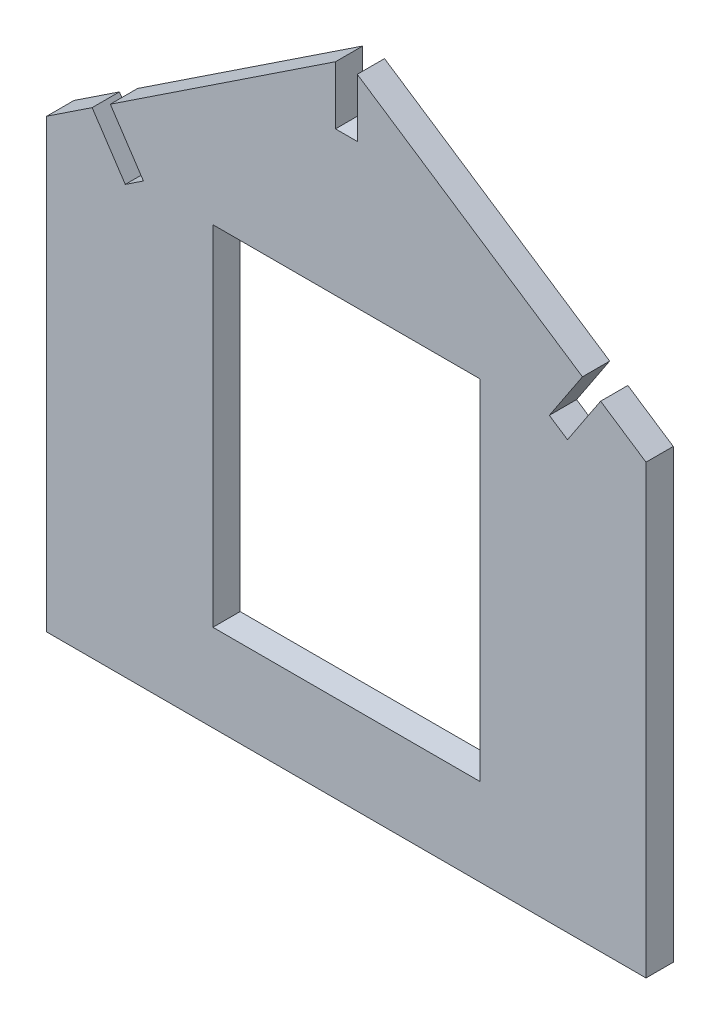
ISO-10303-21;
HEADER;
FILE_DESCRIPTION(('STEP AP214'),'2;1');
FILE_NAME('part.step','',(''),(''),'','','');
FILE_SCHEMA(('AUTOMOTIVE_DESIGN { 1 0 10303 214 1 1 1 1 }'));
ENDSEC;
DATA;
#1=APPLICATION_CONTEXT('core data for automotive mechanical design processes');
#2=APPLICATION_PROTOCOL_DEFINITION('international standard','automotive_design',2000,#1);
#3=PRODUCT_CONTEXT('',#1,'mechanical');
#4=PRODUCT('Part','Part','',(#3));
#5=PRODUCT_RELATED_PRODUCT_CATEGORY('part','',(#4));
#6=PRODUCT_DEFINITION_FORMATION('','',#4);
#7=PRODUCT_DEFINITION_CONTEXT('part definition',#1,'design');
#8=PRODUCT_DEFINITION('design','',#6,#7);
#9=PRODUCT_DEFINITION_SHAPE('','',#8);
#10=(LENGTH_UNIT() NAMED_UNIT(*) SI_UNIT(.MILLI.,.METRE.));
#11=(NAMED_UNIT(*) PLANE_ANGLE_UNIT() SI_UNIT($,.RADIAN.));
#12=(NAMED_UNIT(*) SI_UNIT($,.STERADIAN.) SOLID_ANGLE_UNIT());
#13=UNCERTAINTY_MEASURE_WITH_UNIT(LENGTH_MEASURE(1.E-05),#10,'distance_accuracy_value','');
#14=(GEOMETRIC_REPRESENTATION_CONTEXT(3) GLOBAL_UNCERTAINTY_ASSIGNED_CONTEXT((#13)) GLOBAL_UNIT_ASSIGNED_CONTEXT((#10,
#11,#12)) REPRESENTATION_CONTEXT('',''));
#15=CARTESIAN_POINT('',(0.,0.,0.));
#16=DIRECTION('',(0.,0.,1.));
#17=DIRECTION('',(1.,0.,0.));
#18=AXIS2_PLACEMENT_3D('',#15,#16,#17);
#19=CARTESIAN_POINT('',(-55.,41.,-5.));
#20=DIRECTION('',(-0.552770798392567,0.833333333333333,0.));
#21=DIRECTION('',(-0.833333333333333,-0.552770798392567,0.));
#22=AXIS2_PLACEMENT_3D('',#19,#20,#21);
#23=PLANE('',#22);
#24=DIRECTION('',(-0.833333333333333,-0.552770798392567,0.));
#25=VECTOR('',#24,1.);
#26=CARTESIAN_POINT('',(-55.,41.,0.));
#27=LINE('',#26,#25);
#28=CARTESIAN_POINT('',(-2.,76.1562227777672,0.));
#29=VERTEX_POINT('',#28);
#30=CARTESIAN_POINT('',(-43.3333333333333,48.7387911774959,0.));
#31=VERTEX_POINT('',#30);
#32=EDGE_CURVE('E267',#29,#31,#27,.T.);
#33=ORIENTED_EDGE('',*,*,#32,.F.);
#34=DIRECTION('',(0.,0.,-1.));
#35=VECTOR('',#34,1.);
#36=CARTESIAN_POINT('',(-2.00000000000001,76.1562227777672,-5.));
#37=LINE('',#36,#35);
#38=CARTESIAN_POINT('',(-2.00000000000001,76.1562227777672,-5.));
#39=VERTEX_POINT('',#38);
#40=EDGE_CURVE('E183',#29,#39,#37,.T.);
#41=ORIENTED_EDGE('',*,*,#40,.T.);
#42=DIRECTION('',(-0.833333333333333,-0.552770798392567,0.));
#43=VECTOR('',#42,1.);
#44=CARTESIAN_POINT('',(-55.,41.,-5.));
#45=LINE('',#44,#43);
#46=CARTESIAN_POINT('',(-43.3333333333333,48.7387911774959,-5.));
#47=VERTEX_POINT('',#46);
#48=EDGE_CURVE('E181',#39,#47,#45,.T.);
#49=ORIENTED_EDGE('',*,*,#48,.T.);
#50=DIRECTION('',(0.,0.,-1.));
#51=VECTOR('',#50,1.);
#52=CARTESIAN_POINT('',(-43.3333333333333,48.7387911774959,1.58085940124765));
#53=LINE('',#52,#51);
#54=EDGE_CURVE('E204',#31,#47,#53,.T.);
#55=ORIENTED_EDGE('',*,*,#54,.F.);
#56=EDGE_LOOP('',(#33,#41,#49,#55));
#57=FACE_BOUND('',#56,.T.);
#58=ADVANCED_FACE('F27',(#57),#23,.T.);
#59=CARTESIAN_POINT('',(0.,77.4828726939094,-5.));
#60=DIRECTION('',(0.552770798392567,0.833333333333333,0.));
#61=DIRECTION('',(-0.833333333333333,0.552770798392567,0.));
#62=AXIS2_PLACEMENT_3D('',#59,#60,#61);
#63=PLANE('',#62);
#64=DIRECTION('',(-0.833333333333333,0.552770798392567,0.));
#65=VECTOR('',#64,1.);
#66=CARTESIAN_POINT('',(0.,77.4828726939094,-5.));
#67=LINE('',#66,#65);
#68=CARTESIAN_POINT('',(43.3333333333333,48.7387911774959,-5.));
#69=VERTEX_POINT('',#68);
#70=CARTESIAN_POINT('',(2.,76.1562227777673,-5.));
#71=VERTEX_POINT('',#70);
#72=EDGE_CURVE('E278',#69,#71,#67,.T.);
#73=ORIENTED_EDGE('',*,*,#72,.T.);
#74=DIRECTION('',(0.,0.,1.));
#75=VECTOR('',#74,1.);
#76=CARTESIAN_POINT('',(2.,76.1562227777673,-5.));
#77=LINE('',#76,#75);
#78=CARTESIAN_POINT('',(2.,76.1562227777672,0.));
#79=VERTEX_POINT('',#78);
#80=EDGE_CURVE('E170',#71,#79,#77,.T.);
#81=ORIENTED_EDGE('',*,*,#80,.T.);
#82=DIRECTION('',(-0.833333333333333,0.552770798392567,0.));
#83=VECTOR('',#82,1.);
#84=CARTESIAN_POINT('',(0.,77.4828726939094,0.));
#85=LINE('',#84,#83);
#86=CARTESIAN_POINT('',(43.3333333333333,48.7387911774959,0.));
#87=VERTEX_POINT('',#86);
#88=EDGE_CURVE('E262',#87,#79,#85,.T.);
#89=ORIENTED_EDGE('',*,*,#88,.F.);
#90=DIRECTION('',(0.,0.,1.));
#91=VECTOR('',#90,1.);
#92=CARTESIAN_POINT('',(43.3333333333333,48.7387911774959,2.15028164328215));
#93=LINE('',#92,#91);
#94=EDGE_CURVE('E185',#69,#87,#93,.T.);
#95=ORIENTED_EDGE('',*,*,#94,.F.);
#96=EDGE_LOOP('',(#73,#81,#89,#95));
#97=FACE_BOUND('',#96,.T.);
#98=ADVANCED_FACE('F321',(#97),#63,.T.);
#99=CARTESIAN_POINT('',(-55.,-41.,-5.));
#100=DIRECTION('',(0.,0.,1.));
#101=DIRECTION('',(1.,0.,0.));
#102=AXIS2_PLACEMENT_3D('',#99,#100,#101);
#103=PLANE('',#102);
#104=DIRECTION('',(-1.,0.,0.));
#105=VECTOR('',#104,1.);
#106=CARTESIAN_POINT('',(-24.5,39.,-5.));
#107=LINE('',#106,#105);
#108=CARTESIAN_POINT('',(24.5,39.,-5.));
#109=VERTEX_POINT('',#108);
#110=CARTESIAN_POINT('',(-24.5,39.,-5.));
#111=VERTEX_POINT('',#110);
#112=EDGE_CURVE('E241',#109,#111,#107,.T.);
#113=ORIENTED_EDGE('',*,*,#112,.T.);
#114=DIRECTION('',(0.,-1.,0.));
#115=VECTOR('',#114,1.);
#116=CARTESIAN_POINT('',(-24.5,39.,-5.));
#117=LINE('',#116,#115);
#118=CARTESIAN_POINT('',(-24.5,-25.,-5.));
#119=VERTEX_POINT('',#118);
#120=EDGE_CURVE('E232',#111,#119,#117,.T.);
#121=ORIENTED_EDGE('',*,*,#120,.T.);
#122=DIRECTION('',(1.,0.,0.));
#123=VECTOR('',#122,1.);
#124=CARTESIAN_POINT('',(-24.5,-25.,-5.));
#125=LINE('',#124,#123);
#126=CARTESIAN_POINT('',(24.5,-25.,-5.));
#127=VERTEX_POINT('',#126);
#128=EDGE_CURVE('E235',#119,#127,#125,.T.);
#129=ORIENTED_EDGE('',*,*,#128,.T.);
#130=DIRECTION('',(0.,1.,0.));
#131=VECTOR('',#130,1.);
#132=CARTESIAN_POINT('',(24.5,39.,-5.));
#133=LINE('',#132,#131);
#134=EDGE_CURVE('E238',#127,#109,#133,.T.);
#135=ORIENTED_EDGE('',*,*,#134,.T.);
#136=EDGE_LOOP('',(#113,#121,#129,#135));
#137=FACE_BOUND('',#136,.T.);
#138=DIRECTION('',(0.,1.,0.));
#139=VECTOR('',#138,1.);
#140=CARTESIAN_POINT('',(-2.,-41.,-5.));
#141=LINE('',#140,#139);
#142=CARTESIAN_POINT('',(-2.,65.4828726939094,-5.));
#143=VERTEX_POINT('',#142);
#144=EDGE_CURVE('E174',#143,#39,#141,.T.);
#145=ORIENTED_EDGE('',*,*,#144,.F.);
#146=DIRECTION('',(-1.,0.,0.));
#147=VECTOR('',#146,1.);
#148=CARTESIAN_POINT('',(-55.,65.4828726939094,-5.));
#149=LINE('',#148,#147);
#150=CARTESIAN_POINT('',(2.,65.4828726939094,-5.));
#151=VERTEX_POINT('',#150);
#152=EDGE_CURVE('E163',#151,#143,#149,.T.);
#153=ORIENTED_EDGE('',*,*,#152,.F.);
#154=DIRECTION('',(0.,-1.,0.));
#155=VECTOR('',#154,1.);
#156=CARTESIAN_POINT('',(2.,-41.,-5.));
#157=LINE('',#156,#155);
#158=EDGE_CURVE('E187',#71,#151,#157,.T.);
#159=ORIENTED_EDGE('',*,*,#158,.F.);
#160=ORIENTED_EDGE('',*,*,#72,.F.);
#161=DIRECTION('',(-0.552770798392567,-0.833333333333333,0.));
#162=VECTOR('',#161,1.);
#163=CARTESIAN_POINT('',(-28.0504490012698,-58.8763097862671,-5.));
#164=LINE('',#163,#162);
#165=CARTESIAN_POINT('',(37.2528545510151,39.5721245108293,-5.));
#166=VERTEX_POINT('',#165);
#167=EDGE_CURVE('E198',#69,#166,#164,.T.);
#168=ORIENTED_EDGE('',*,*,#167,.T.);
#169=DIRECTION('',(-0.833333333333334,0.552770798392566,0.));
#170=VECTOR('',#169,1.);
#171=CARTESIAN_POINT('',(10.3033035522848,57.4484342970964,-5.));
#172=LINE('',#171,#170);
#173=CARTESIAN_POINT('',(40.5861878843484,37.361041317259,-5.));
#174=VERTEX_POINT('',#173);
#175=EDGE_CURVE('E196',#174,#166,#172,.T.);
#176=ORIENTED_EDGE('',*,*,#175,.F.);
#177=DIRECTION('',(0.552770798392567,0.833333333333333,0.));
#178=VECTOR('',#177,1.);
#179=CARTESIAN_POINT('',(-24.7171156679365,-61.0873929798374,-5.));
#180=LINE('',#179,#178);
#181=CARTESIAN_POINT('',(46.6666666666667,46.5277079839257,-5.));
#182=VERTEX_POINT('',#181);
#183=EDGE_CURVE('E201',#174,#182,#180,.T.);
#184=ORIENTED_EDGE('',*,*,#183,.T.);
#185=CARTESIAN_POINT('',(55.,41.,-5.));
#186=VERTEX_POINT('',#185);
#187=EDGE_CURVE('E279',#186,#182,#67,.T.);
#188=ORIENTED_EDGE('',*,*,#187,.F.);
#189=DIRECTION('',(0.,1.,0.));
#190=VECTOR('',#189,1.);
#191=CARTESIAN_POINT('',(55.,41.,-5.));
#192=LINE('',#191,#190);
#193=CARTESIAN_POINT('',(55.,-41.,-5.));
#194=VERTEX_POINT('',#193);
#195=EDGE_CURVE('E275',#194,#186,#192,.T.);
#196=ORIENTED_EDGE('',*,*,#195,.F.);
#197=DIRECTION('',(1.,0.,0.));
#198=VECTOR('',#197,1.);
#199=CARTESIAN_POINT('',(-55.,-41.,-5.));
#200=LINE('',#199,#198);
#201=CARTESIAN_POINT('',(-55.,-41.,-5.));
#202=VERTEX_POINT('',#201);
#203=EDGE_CURVE('E272',#202,#194,#200,.T.);
#204=ORIENTED_EDGE('',*,*,#203,.F.);
#205=DIRECTION('',(0.,-1.,0.));
#206=VECTOR('',#205,1.);
#207=CARTESIAN_POINT('',(-55.,41.,-5.));
#208=LINE('',#207,#206);
#209=CARTESIAN_POINT('',(-55.,41.,-5.));
#210=VERTEX_POINT('',#209);
#211=EDGE_CURVE('E269',#210,#202,#208,.T.);
#212=ORIENTED_EDGE('',*,*,#211,.F.);
#213=CARTESIAN_POINT('',(-46.6666666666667,46.5277079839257,-5.));
#214=VERTEX_POINT('',#213);
#215=EDGE_CURVE('E282',#214,#210,#45,.T.);
#216=ORIENTED_EDGE('',*,*,#215,.F.);
#217=DIRECTION('',(0.552770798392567,-0.833333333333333,0.));
#218=VECTOR('',#217,1.);
#219=CARTESIAN_POINT('',(-8.89399544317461,-10.4167364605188,-5.));
#220=LINE('',#219,#218);
#221=CARTESIAN_POINT('',(-40.5861878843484,37.361041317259,-5.));
#222=VERTEX_POINT('',#221);
#223=EDGE_CURVE('E216',#214,#222,#220,.T.);
#224=ORIENTED_EDGE('',*,*,#223,.T.);
#225=DIRECTION('',(-0.833333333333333,-0.552770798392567,0.));
#226=VECTOR('',#225,1.);
#227=CARTESIAN_POINT('',(-86.6921924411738,6.7777777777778,-5.));
#228=LINE('',#227,#226);
#229=CARTESIAN_POINT('',(-37.2528545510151,39.5721245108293,-5.));
#230=VERTEX_POINT('',#229);
#231=EDGE_CURVE('E214',#230,#222,#228,.T.);
#232=ORIENTED_EDGE('',*,*,#231,.F.);
#233=DIRECTION('',(-0.552770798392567,0.833333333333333,0.));
#234=VECTOR('',#233,1.);
#235=CARTESIAN_POINT('',(-5.56066210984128,-8.20565326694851,-5.));
#236=LINE('',#235,#234);
#237=EDGE_CURVE('E219',#230,#47,#236,.T.);
#238=ORIENTED_EDGE('',*,*,#237,.T.);
#239=ORIENTED_EDGE('',*,*,#48,.F.);
#240=EDGE_LOOP('',(#145,#153,#159,#160,#168,#176,#184,#188,#196,#204,#212,#216,#224,#232,#238,#239));
#241=FACE_BOUND('',#240,.T.);
#242=ADVANCED_FACE('F179',(#137,#241),#103,.F.);
#243=CARTESIAN_POINT('',(-55.,-41.,0.));
#244=DIRECTION('',(0.,0.,1.));
#245=DIRECTION('',(1.,0.,0.));
#246=AXIS2_PLACEMENT_3D('',#243,#244,#245);
#247=PLANE('',#246);
#248=DIRECTION('',(0.,-1.,0.));
#249=VECTOR('',#248,1.);
#250=CARTESIAN_POINT('',(-24.5,39.,0.));
#251=LINE('',#250,#249);
#252=CARTESIAN_POINT('',(-24.5,39.,0.));
#253=VERTEX_POINT('',#252);
#254=CARTESIAN_POINT('',(-24.5,-25.,0.));
#255=VERTEX_POINT('',#254);
#256=EDGE_CURVE('E221',#253,#255,#251,.T.);
#257=ORIENTED_EDGE('',*,*,#256,.F.);
#258=DIRECTION('',(-1.,0.,0.));
#259=VECTOR('',#258,1.);
#260=CARTESIAN_POINT('',(-24.5,39.,0.));
#261=LINE('',#260,#259);
#262=CARTESIAN_POINT('',(24.5,39.,0.));
#263=VERTEX_POINT('',#262);
#264=EDGE_CURVE('E229',#263,#253,#261,.T.);
#265=ORIENTED_EDGE('',*,*,#264,.F.);
#266=DIRECTION('',(0.,1.,0.));
#267=VECTOR('',#266,1.);
#268=CARTESIAN_POINT('',(24.5,39.,0.));
#269=LINE('',#268,#267);
#270=CARTESIAN_POINT('',(24.5,-25.,0.));
#271=VERTEX_POINT('',#270);
#272=EDGE_CURVE('E226',#271,#263,#269,.T.);
#273=ORIENTED_EDGE('',*,*,#272,.F.);
#274=DIRECTION('',(1.,0.,0.));
#275=VECTOR('',#274,1.);
#276=CARTESIAN_POINT('',(-24.5,-25.,0.));
#277=LINE('',#276,#275);
#278=EDGE_CURVE('E223',#255,#271,#277,.T.);
#279=ORIENTED_EDGE('',*,*,#278,.F.);
#280=EDGE_LOOP('',(#257,#265,#273,#279));
#281=FACE_BOUND('',#280,.T.);
#282=DIRECTION('',(-1.,0.,0.));
#283=VECTOR('',#282,1.);
#284=CARTESIAN_POINT('',(-55.,65.4828726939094,0.));
#285=LINE('',#284,#283);
#286=CARTESIAN_POINT('',(2.,65.4828726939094,0.));
#287=VERTEX_POINT('',#286);
#288=CARTESIAN_POINT('',(-2.,65.4828726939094,0.));
#289=VERTEX_POINT('',#288);
#290=EDGE_CURVE('E309',#287,#289,#285,.T.);
#291=ORIENTED_EDGE('',*,*,#290,.T.);
#292=DIRECTION('',(0.,1.,0.));
#293=VECTOR('',#292,1.);
#294=CARTESIAN_POINT('',(-2.,-41.,0.));
#295=LINE('',#294,#293);
#296=EDGE_CURVE('E11',#289,#29,#295,.T.);
#297=ORIENTED_EDGE('',*,*,#296,.T.);
#298=ORIENTED_EDGE('',*,*,#32,.T.);
#299=DIRECTION('',(-0.552770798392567,0.833333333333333,0.));
#300=VECTOR('',#299,1.);
#301=CARTESIAN_POINT('',(-5.56066210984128,-8.20565326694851,0.));
#302=LINE('',#301,#300);
#303=CARTESIAN_POINT('',(-37.2528545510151,39.5721245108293,0.));
#304=VERTEX_POINT('',#303);
#305=EDGE_CURVE('E299',#304,#31,#302,.T.);
#306=ORIENTED_EDGE('',*,*,#305,.F.);
#307=DIRECTION('',(-0.833333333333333,-0.552770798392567,0.));
#308=VECTOR('',#307,1.);
#309=CARTESIAN_POINT('',(-86.6921924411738,6.7777777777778,0.));
#310=LINE('',#309,#308);
#311=CARTESIAN_POINT('',(-40.5861878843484,37.361041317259,0.));
#312=VERTEX_POINT('',#311);
#313=EDGE_CURVE('E288',#304,#312,#310,.T.);
#314=ORIENTED_EDGE('',*,*,#313,.T.);
#315=DIRECTION('',(0.552770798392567,-0.833333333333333,0.));
#316=VECTOR('',#315,1.);
#317=CARTESIAN_POINT('',(-8.89399544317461,-10.4167364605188,0.));
#318=LINE('',#317,#316);
#319=CARTESIAN_POINT('',(-46.6666666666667,46.5277079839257,0.));
#320=VERTEX_POINT('',#319);
#321=EDGE_CURVE('E296',#320,#312,#318,.T.);
#322=ORIENTED_EDGE('',*,*,#321,.F.);
#323=CARTESIAN_POINT('',(-55.,41.,0.));
#324=VERTEX_POINT('',#323);
#325=EDGE_CURVE('E266',#320,#324,#27,.T.);
#326=ORIENTED_EDGE('',*,*,#325,.T.);
#327=DIRECTION('',(0.,-1.,0.));
#328=VECTOR('',#327,1.);
#329=CARTESIAN_POINT('',(-55.,41.,0.));
#330=LINE('',#329,#328);
#331=CARTESIAN_POINT('',(-55.,-41.,0.));
#332=VERTEX_POINT('',#331);
#333=EDGE_CURVE('E247',#324,#332,#330,.T.);
#334=ORIENTED_EDGE('',*,*,#333,.T.);
#335=DIRECTION('',(1.,0.,0.));
#336=VECTOR('',#335,1.);
#337=CARTESIAN_POINT('',(-55.,-41.,0.));
#338=LINE('',#337,#336);
#339=CARTESIAN_POINT('',(55.,-41.,0.));
#340=VERTEX_POINT('',#339);
#341=EDGE_CURVE('E256',#332,#340,#338,.T.);
#342=ORIENTED_EDGE('',*,*,#341,.T.);
#343=DIRECTION('',(0.,1.,0.));
#344=VECTOR('',#343,1.);
#345=CARTESIAN_POINT('',(55.,41.,0.));
#346=LINE('',#345,#344);
#347=CARTESIAN_POINT('',(55.,41.,0.));
#348=VERTEX_POINT('',#347);
#349=EDGE_CURVE('E259',#340,#348,#346,.T.);
#350=ORIENTED_EDGE('',*,*,#349,.T.);
#351=CARTESIAN_POINT('',(46.6666666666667,46.5277079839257,0.));
#352=VERTEX_POINT('',#351);
#353=EDGE_CURVE('E263',#348,#352,#85,.T.);
#354=ORIENTED_EDGE('',*,*,#353,.T.);
#355=DIRECTION('',(0.552770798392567,0.833333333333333,0.));
#356=VECTOR('',#355,1.);
#357=CARTESIAN_POINT('',(-24.7171156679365,-61.0873929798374,0.));
#358=LINE('',#357,#356);
#359=CARTESIAN_POINT('',(40.5861878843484,37.361041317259,0.));
#360=VERTEX_POINT('',#359);
#361=EDGE_CURVE('E307',#360,#352,#358,.T.);
#362=ORIENTED_EDGE('',*,*,#361,.F.);
#363=DIRECTION('',(-0.833333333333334,0.552770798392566,0.));
#364=VECTOR('',#363,1.);
#365=CARTESIAN_POINT('',(10.3033035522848,57.4484342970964,0.));
#366=LINE('',#365,#364);
#367=CARTESIAN_POINT('',(37.2528545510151,39.5721245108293,0.));
#368=VERTEX_POINT('',#367);
#369=EDGE_CURVE('E302',#360,#368,#366,.T.);
#370=ORIENTED_EDGE('',*,*,#369,.T.);
#371=DIRECTION('',(-0.552770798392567,-0.833333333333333,0.));
#372=VECTOR('',#371,1.);
#373=CARTESIAN_POINT('',(-28.0504490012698,-58.8763097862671,0.));
#374=LINE('',#373,#372);
#375=EDGE_CURVE('E305',#87,#368,#374,.T.);
#376=ORIENTED_EDGE('',*,*,#375,.F.);
#377=ORIENTED_EDGE('',*,*,#88,.T.);
#378=DIRECTION('',(0.,-1.,0.));
#379=VECTOR('',#378,1.);
#380=CARTESIAN_POINT('',(2.,-41.,0.));
#381=LINE('',#380,#379);
#382=EDGE_CURVE('E35',#79,#287,#381,.T.);
#383=ORIENTED_EDGE('',*,*,#382,.T.);
#384=EDGE_LOOP('',(#291,#297,#298,#306,#314,#322,#326,#334,#342,#350,#354,#362,#370,#376,#377,#383));
#385=FACE_BOUND('',#384,.T.);
#386=ADVANCED_FACE('F313',(#281,#385),#247,.T.);
#387=DIRECTION('',(0.,0.,-1.));
#388=VECTOR('',#387,1.);
#389=CARTESIAN_POINT('',(46.6666666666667,46.5277079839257,2.15028164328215));
#390=LINE('',#389,#388);
#391=EDGE_CURVE('E182',#352,#182,#390,.T.);
#392=ORIENTED_EDGE('',*,*,#391,.F.);
#393=ORIENTED_EDGE('',*,*,#353,.F.);
#394=DIRECTION('',(0.,0.,1.));
#395=VECTOR('',#394,1.);
#396=CARTESIAN_POINT('',(55.,41.,-5.));
#397=LINE('',#396,#395);
#398=EDGE_CURVE('E289',#186,#348,#397,.T.);
#399=ORIENTED_EDGE('',*,*,#398,.F.);
#400=ORIENTED_EDGE('',*,*,#187,.T.);
#401=EDGE_LOOP('',(#392,#393,#399,#400));
#402=FACE_BOUND('',#401,.T.);
#403=ADVANCED_FACE('F338',(#402),#63,.T.);
#404=CARTESIAN_POINT('',(-55.,41.,-5.));
#405=DIRECTION('',(-1.,0.,0.));
#406=DIRECTION('',(0.,0.,1.));
#407=AXIS2_PLACEMENT_3D('',#404,#405,#406);
#408=PLANE('',#407);
#409=ORIENTED_EDGE('',*,*,#333,.F.);
#410=DIRECTION('',(0.,0.,1.));
#411=VECTOR('',#410,1.);
#412=CARTESIAN_POINT('',(-55.,41.,-5.));
#413=LINE('',#412,#411);
#414=EDGE_CURVE('E285',#210,#324,#413,.T.);
#415=ORIENTED_EDGE('',*,*,#414,.F.);
#416=ORIENTED_EDGE('',*,*,#211,.T.);
#417=DIRECTION('',(0.,0.,1.));
#418=VECTOR('',#417,1.);
#419=CARTESIAN_POINT('',(-55.,-41.,-5.));
#420=LINE('',#419,#418);
#421=EDGE_CURVE('E284',#202,#332,#420,.T.);
#422=ORIENTED_EDGE('',*,*,#421,.T.);
#423=EDGE_LOOP('',(#409,#415,#416,#422));
#424=FACE_BOUND('',#423,.T.);
#425=ADVANCED_FACE('F29',(#424),#408,.T.);
#426=DIRECTION('',(0.,0.,1.));
#427=VECTOR('',#426,1.);
#428=CARTESIAN_POINT('',(-46.6666666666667,46.5277079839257,1.58085940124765));
#429=LINE('',#428,#427);
#430=EDGE_CURVE('E207',#214,#320,#429,.T.);
#431=ORIENTED_EDGE('',*,*,#430,.F.);
#432=ORIENTED_EDGE('',*,*,#215,.T.);
#433=ORIENTED_EDGE('',*,*,#414,.T.);
#434=ORIENTED_EDGE('',*,*,#325,.F.);
#435=EDGE_LOOP('',(#431,#432,#433,#434));
#436=FACE_BOUND('',#435,.T.);
#437=ADVANCED_FACE('F355',(#436),#23,.T.);
#438=CARTESIAN_POINT('',(55.,41.,-5.));
#439=DIRECTION('',(1.,0.,0.));
#440=DIRECTION('',(0.,0.,-1.));
#441=AXIS2_PLACEMENT_3D('',#438,#439,#440);
#442=PLANE('',#441);
#443=ORIENTED_EDGE('',*,*,#349,.F.);
#444=DIRECTION('',(0.,0.,1.));
#445=VECTOR('',#444,1.);
#446=CARTESIAN_POINT('',(55.,-41.,-5.));
#447=LINE('',#446,#445);
#448=EDGE_CURVE('E291',#194,#340,#447,.T.);
#449=ORIENTED_EDGE('',*,*,#448,.F.);
#450=ORIENTED_EDGE('',*,*,#195,.T.);
#451=ORIENTED_EDGE('',*,*,#398,.T.);
#452=EDGE_LOOP('',(#443,#449,#450,#451));
#453=FACE_BOUND('',#452,.T.);
#454=ADVANCED_FACE('F342',(#453),#442,.T.);
#455=CARTESIAN_POINT('',(-55.,-41.,-5.));
#456=DIRECTION('',(0.,-1.,0.));
#457=DIRECTION('',(0.,0.,-1.));
#458=AXIS2_PLACEMENT_3D('',#455,#456,#457);
#459=PLANE('',#458);
#460=ORIENTED_EDGE('',*,*,#341,.F.);
#461=ORIENTED_EDGE('',*,*,#421,.F.);
#462=ORIENTED_EDGE('',*,*,#203,.T.);
#463=ORIENTED_EDGE('',*,*,#448,.T.);
#464=EDGE_LOOP('',(#460,#461,#462,#463));
#465=FACE_BOUND('',#464,.T.);
#466=ADVANCED_FACE('F347',(#465),#459,.T.);
#467=CARTESIAN_POINT('',(-24.5,39.,-5.));
#468=DIRECTION('',(-1.,0.,0.));
#469=DIRECTION('',(0.,-1.,0.));
#470=AXIS2_PLACEMENT_3D('',#467,#468,#469);
#471=PLANE('',#470);
#472=ORIENTED_EDGE('',*,*,#256,.T.);
#473=DIRECTION('',(0.,0.,1.));
#474=VECTOR('',#473,1.);
#475=CARTESIAN_POINT('',(-24.5,-25.,-5.));
#476=LINE('',#475,#474);
#477=EDGE_CURVE('E244',#119,#255,#476,.T.);
#478=ORIENTED_EDGE('',*,*,#477,.F.);
#479=ORIENTED_EDGE('',*,*,#120,.F.);
#480=DIRECTION('',(0.,0.,1.));
#481=VECTOR('',#480,1.);
#482=CARTESIAN_POINT('',(-24.5,39.,-5.));
#483=LINE('',#482,#481);
#484=EDGE_CURVE('E245',#111,#253,#483,.T.);
#485=ORIENTED_EDGE('',*,*,#484,.T.);
#486=EDGE_LOOP('',(#472,#478,#479,#485));
#487=FACE_BOUND('',#486,.T.);
#488=ADVANCED_FACE('F397',(#487),#471,.F.);
#489=CARTESIAN_POINT('',(-24.5,39.,-5.));
#490=DIRECTION('',(0.,1.,0.));
#491=DIRECTION('',(0.,0.,1.));
#492=AXIS2_PLACEMENT_3D('',#489,#490,#491);
#493=PLANE('',#492);
#494=ORIENTED_EDGE('',*,*,#264,.T.);
#495=ORIENTED_EDGE('',*,*,#484,.F.);
#496=ORIENTED_EDGE('',*,*,#112,.F.);
#497=DIRECTION('',(0.,0.,1.));
#498=VECTOR('',#497,1.);
#499=CARTESIAN_POINT('',(24.5,39.,-5.));
#500=LINE('',#499,#498);
#501=EDGE_CURVE('E248',#109,#263,#500,.T.);
#502=ORIENTED_EDGE('',*,*,#501,.T.);
#503=EDGE_LOOP('',(#494,#495,#496,#502));
#504=FACE_BOUND('',#503,.T.);
#505=ADVANCED_FACE('F401',(#504),#493,.F.);
#506=CARTESIAN_POINT('',(24.5,39.,-5.));
#507=DIRECTION('',(1.,0.,0.));
#508=DIRECTION('',(0.,1.,0.));
#509=AXIS2_PLACEMENT_3D('',#506,#507,#508);
#510=PLANE('',#509);
#511=ORIENTED_EDGE('',*,*,#272,.T.);
#512=ORIENTED_EDGE('',*,*,#501,.F.);
#513=ORIENTED_EDGE('',*,*,#134,.F.);
#514=DIRECTION('',(0.,0.,1.));
#515=VECTOR('',#514,1.);
#516=CARTESIAN_POINT('',(24.5,-25.,-5.));
#517=LINE('',#516,#515);
#518=EDGE_CURVE('E250',#127,#271,#517,.T.);
#519=ORIENTED_EDGE('',*,*,#518,.T.);
#520=EDGE_LOOP('',(#511,#512,#513,#519));
#521=FACE_BOUND('',#520,.T.);
#522=ADVANCED_FACE('F407',(#521),#510,.F.);
#523=CARTESIAN_POINT('',(-24.5,-25.,-5.));
#524=DIRECTION('',(0.,-1.,0.));
#525=DIRECTION('',(0.,0.,-1.));
#526=AXIS2_PLACEMENT_3D('',#523,#524,#525);
#527=PLANE('',#526);
#528=ORIENTED_EDGE('',*,*,#278,.T.);
#529=ORIENTED_EDGE('',*,*,#518,.F.);
#530=ORIENTED_EDGE('',*,*,#128,.F.);
#531=ORIENTED_EDGE('',*,*,#477,.T.);
#532=EDGE_LOOP('',(#528,#529,#530,#531));
#533=FACE_BOUND('',#532,.T.);
#534=ADVANCED_FACE('F411',(#533),#527,.F.);
#535=CARTESIAN_POINT('',(-37.2528545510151,39.5721245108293,1.58085940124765));
#536=DIRECTION('',(0.833333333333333,0.552770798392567,0.));
#537=DIRECTION('',(-0.552770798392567,0.833333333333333,0.));
#538=AXIS2_PLACEMENT_3D('',#535,#536,#537);
#539=PLANE('',#538);
#540=DIRECTION('',(0.,0.,-1.));
#541=VECTOR('',#540,1.);
#542=CARTESIAN_POINT('',(-37.2528545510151,39.5721245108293,1.58085940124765));
#543=LINE('',#542,#541);
#544=EDGE_CURVE('E209',#304,#230,#543,.T.);
#545=ORIENTED_EDGE('',*,*,#544,.F.);
#546=ORIENTED_EDGE('',*,*,#305,.T.);
#547=ORIENTED_EDGE('',*,*,#54,.T.);
#548=ORIENTED_EDGE('',*,*,#237,.F.);
#549=EDGE_LOOP('',(#545,#546,#547,#548));
#550=FACE_BOUND('',#549,.T.);
#551=ADVANCED_FACE('F366',(#550),#539,.F.);
#552=CARTESIAN_POINT('',(-40.5861878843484,37.361041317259,1.58085940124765));
#553=DIRECTION('',(-0.833333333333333,-0.552770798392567,0.));
#554=DIRECTION('',(0.552770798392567,-0.833333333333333,0.));
#555=AXIS2_PLACEMENT_3D('',#552,#553,#554);
#556=PLANE('',#555);
#557=ORIENTED_EDGE('',*,*,#430,.T.);
#558=ORIENTED_EDGE('',*,*,#321,.T.);
#559=DIRECTION('',(0.,0.,1.));
#560=VECTOR('',#559,1.);
#561=CARTESIAN_POINT('',(-40.5861878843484,37.361041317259,1.58085940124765));
#562=LINE('',#561,#560);
#563=EDGE_CURVE('E212',#222,#312,#562,.T.);
#564=ORIENTED_EDGE('',*,*,#563,.F.);
#565=ORIENTED_EDGE('',*,*,#223,.F.);
#566=EDGE_LOOP('',(#557,#558,#564,#565));
#567=FACE_BOUND('',#566,.T.);
#568=ADVANCED_FACE('F359',(#567),#556,.F.);
#569=CARTESIAN_POINT('',(-37.2528545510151,39.5721245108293,-7.90951129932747));
#570=DIRECTION('',(-0.552770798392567,0.833333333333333,0.));
#571=DIRECTION('',(-0.833333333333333,-0.552770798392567,0.));
#572=AXIS2_PLACEMENT_3D('',#569,#570,#571);
#573=PLANE('',#572);
#574=ORIENTED_EDGE('',*,*,#231,.T.);
#575=ORIENTED_EDGE('',*,*,#563,.T.);
#576=ORIENTED_EDGE('',*,*,#313,.F.);
#577=ORIENTED_EDGE('',*,*,#544,.T.);
#578=EDGE_LOOP('',(#574,#575,#576,#577));
#579=FACE_BOUND('',#578,.T.);
#580=ADVANCED_FACE('F364',(#579),#573,.T.);
#581=CARTESIAN_POINT('',(40.5861878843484,37.361041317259,2.15028164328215));
#582=DIRECTION('',(0.833333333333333,-0.552770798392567,0.));
#583=DIRECTION('',(0.552770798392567,0.833333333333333,0.));
#584=AXIS2_PLACEMENT_3D('',#581,#582,#583);
#585=PLANE('',#584);
#586=DIRECTION('',(0.,0.,-1.));
#587=VECTOR('',#586,1.);
#588=CARTESIAN_POINT('',(40.5861878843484,37.361041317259,2.15028164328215));
#589=LINE('',#588,#587);
#590=EDGE_CURVE('E192',#360,#174,#589,.T.);
#591=ORIENTED_EDGE('',*,*,#590,.F.);
#592=ORIENTED_EDGE('',*,*,#361,.T.);
#593=ORIENTED_EDGE('',*,*,#391,.T.);
#594=ORIENTED_EDGE('',*,*,#183,.F.);
#595=EDGE_LOOP('',(#591,#592,#593,#594));
#596=FACE_BOUND('',#595,.T.);
#597=ADVANCED_FACE('F333',(#596),#585,.F.);
#598=CARTESIAN_POINT('',(37.2528545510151,39.5721245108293,2.15028164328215));
#599=DIRECTION('',(-0.833333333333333,0.552770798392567,0.));
#600=DIRECTION('',(-0.552770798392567,-0.833333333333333,0.));
#601=AXIS2_PLACEMENT_3D('',#598,#599,#600);
#602=PLANE('',#601);
#603=ORIENTED_EDGE('',*,*,#94,.T.);
#604=ORIENTED_EDGE('',*,*,#375,.T.);
#605=DIRECTION('',(0.,0.,1.));
#606=VECTOR('',#605,1.);
#607=CARTESIAN_POINT('',(37.2528545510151,39.5721245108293,2.15028164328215));
#608=LINE('',#607,#606);
#609=EDGE_CURVE('E50',#166,#368,#608,.T.);
#610=ORIENTED_EDGE('',*,*,#609,.F.);
#611=ORIENTED_EDGE('',*,*,#167,.F.);
#612=EDGE_LOOP('',(#603,#604,#610,#611));
#613=FACE_BOUND('',#612,.T.);
#614=ADVANCED_FACE('F328',(#613),#602,.F.);
#615=CARTESIAN_POINT('',(40.5861878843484,37.361041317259,-7.90951129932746));
#616=DIRECTION('',(0.552770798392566,0.833333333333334,0.));
#617=DIRECTION('',(-0.833333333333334,0.552770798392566,0.));
#618=AXIS2_PLACEMENT_3D('',#615,#616,#617);
#619=PLANE('',#618);
#620=ORIENTED_EDGE('',*,*,#175,.T.);
#621=ORIENTED_EDGE('',*,*,#609,.T.);
#622=ORIENTED_EDGE('',*,*,#369,.F.);
#623=ORIENTED_EDGE('',*,*,#590,.T.);
#624=EDGE_LOOP('',(#620,#621,#622,#623));
#625=FACE_BOUND('',#624,.T.);
#626=ADVANCED_FACE('F331',(#625),#619,.T.);
#627=CARTESIAN_POINT('',(-2.,65.4828726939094,-7.24939613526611));
#628=DIRECTION('',(1.,0.,0.));
#629=DIRECTION('',(0.,0.,-1.));
#630=AXIS2_PLACEMENT_3D('',#627,#628,#629);
#631=PLANE('',#630);
#632=ORIENTED_EDGE('',*,*,#144,.T.);
#633=ORIENTED_EDGE('',*,*,#40,.F.);
#634=ORIENTED_EDGE('',*,*,#296,.F.);
#635=DIRECTION('',(0.,0.,-1.));
#636=VECTOR('',#635,1.);
#637=CARTESIAN_POINT('',(-2.,65.4828726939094,-7.24939613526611));
#638=LINE('',#637,#636);
#639=EDGE_CURVE('E42',#289,#143,#638,.T.);
#640=ORIENTED_EDGE('',*,*,#639,.T.);
#641=EDGE_LOOP('',(#632,#633,#634,#640));
#642=FACE_BOUND('',#641,.T.);
#643=ADVANCED_FACE('F173',(#642),#631,.T.);
#644=CARTESIAN_POINT('',(2.,65.4828726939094,-7.24939613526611));
#645=DIRECTION('',(-1.,0.,0.));
#646=DIRECTION('',(0.,0.,1.));
#647=AXIS2_PLACEMENT_3D('',#644,#645,#646);
#648=PLANE('',#647);
#649=ORIENTED_EDGE('',*,*,#158,.T.);
#650=DIRECTION('',(0.,0.,1.));
#651=VECTOR('',#650,1.);
#652=CARTESIAN_POINT('',(2.,65.4828726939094,-7.24939613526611));
#653=LINE('',#652,#651);
#654=EDGE_CURVE('E166',#151,#287,#653,.T.);
#655=ORIENTED_EDGE('',*,*,#654,.T.);
#656=ORIENTED_EDGE('',*,*,#382,.F.);
#657=ORIENTED_EDGE('',*,*,#80,.F.);
#658=EDGE_LOOP('',(#649,#655,#656,#657));
#659=FACE_BOUND('',#658,.T.);
#660=ADVANCED_FACE('F318',(#659),#648,.T.);
#661=CARTESIAN_POINT('',(-2.,65.4828726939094,2.39553140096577));
#662=DIRECTION('',(0.,1.,0.));
#663=DIRECTION('',(0.,0.,1.));
#664=AXIS2_PLACEMENT_3D('',#661,#662,#663);
#665=PLANE('',#664);
#666=ORIENTED_EDGE('',*,*,#152,.T.);
#667=ORIENTED_EDGE('',*,*,#639,.F.);
#668=ORIENTED_EDGE('',*,*,#290,.F.);
#669=ORIENTED_EDGE('',*,*,#654,.F.);
#670=EDGE_LOOP('',(#666,#667,#668,#669));
#671=FACE_BOUND('',#670,.T.);
#672=ADVANCED_FACE('F164',(#671),#665,.T.);
#673=CLOSED_SHELL('',(#58,#98,#242,#386,#403,#425,#437,#454,#466,#488,#505,#522,#534,#551,#568,
#580,#597,#614,#626,#643,#660,#672));
#674=MANIFOLD_SOLID_BREP('B2',#673);
#675=ADVANCED_BREP_SHAPE_REPRESENTATION('',(#18,#674),#14);
#676=SHAPE_DEFINITION_REPRESENTATION(#9,#675);
ENDSEC;
END-ISO-10303-21;
